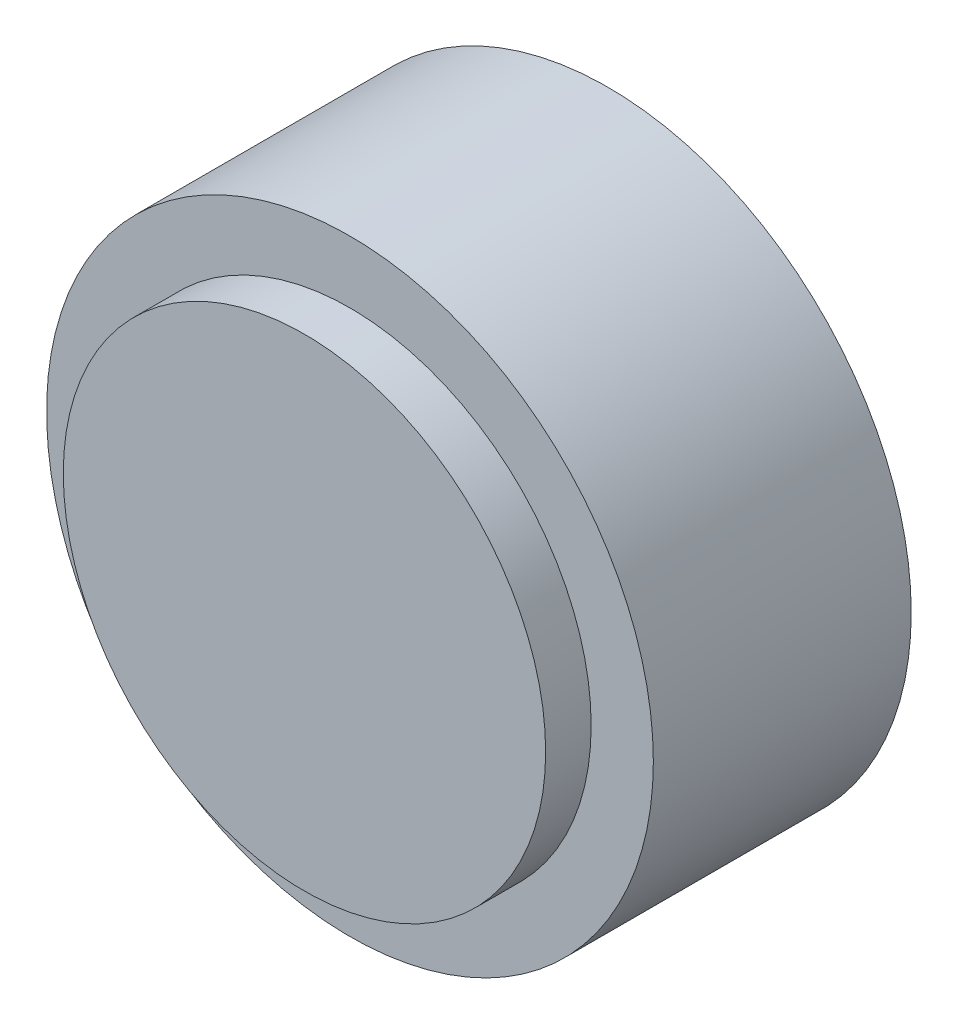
ISO-10303-21;
HEADER;
FILE_DESCRIPTION(('STEP AP214'),'2;1');
FILE_NAME('part.step','',(''),(''),'','','');
FILE_SCHEMA(('AUTOMOTIVE_DESIGN { 1 0 10303 214 1 1 1 1 }'));
ENDSEC;
DATA;
#1=APPLICATION_CONTEXT('core data for automotive mechanical design processes');
#2=APPLICATION_PROTOCOL_DEFINITION('international standard','automotive_design',2000,#1);
#3=PRODUCT_CONTEXT('',#1,'mechanical');
#4=PRODUCT('Part','Part','',(#3));
#5=PRODUCT_RELATED_PRODUCT_CATEGORY('part','',(#4));
#6=PRODUCT_DEFINITION_FORMATION('','',#4);
#7=PRODUCT_DEFINITION_CONTEXT('part definition',#1,'design');
#8=PRODUCT_DEFINITION('design','',#6,#7);
#9=PRODUCT_DEFINITION_SHAPE('','',#8);
#10=(LENGTH_UNIT() NAMED_UNIT(*) SI_UNIT(.MILLI.,.METRE.));
#11=(NAMED_UNIT(*) PLANE_ANGLE_UNIT() SI_UNIT($,.RADIAN.));
#12=(NAMED_UNIT(*) SI_UNIT($,.STERADIAN.) SOLID_ANGLE_UNIT());
#13=UNCERTAINTY_MEASURE_WITH_UNIT(LENGTH_MEASURE(1.E-05),#10,'distance_accuracy_value','');
#14=(GEOMETRIC_REPRESENTATION_CONTEXT(3) GLOBAL_UNCERTAINTY_ASSIGNED_CONTEXT((#13)) GLOBAL_UNIT_ASSIGNED_CONTEXT((#10,
#11,#12)) REPRESENTATION_CONTEXT('',''));
#15=CARTESIAN_POINT('',(0.,0.,0.));
#16=DIRECTION('',(0.,0.,1.));
#17=DIRECTION('',(1.,0.,0.));
#18=AXIS2_PLACEMENT_3D('',#15,#16,#17);
#19=CARTESIAN_POINT('',(0.,0.,30.));
#20=DIRECTION('',(0.,0.,1.));
#21=DIRECTION('',(1.,0.,0.));
#22=AXIS2_PLACEMENT_3D('',#19,#20,#21);
#23=CYLINDRICAL_SURFACE('',#22,10.);
#24=CARTESIAN_POINT('',(0.,0.,0.));
#25=DIRECTION('',(0.,0.,1.));
#26=DIRECTION('',(1.,0.,0.));
#27=AXIS2_PLACEMENT_3D('',#24,#25,#26);
#28=CIRCLE('',#27,10.);
#29=CARTESIAN_POINT('',(10.,0.,0.));
#30=VERTEX_POINT('',#29);
#31=EDGE_CURVE('E8',#30,#30,#28,.T.);
#32=ORIENTED_EDGE('',*,*,#31,.T.);
#33=EDGE_LOOP('',(#32));
#34=FACE_BOUND('',#33,.T.);
#35=CARTESIAN_POINT('',(0.,0.,8.5));
#36=DIRECTION('',(0.,0.,1.));
#37=DIRECTION('',(1.,0.,0.));
#38=AXIS2_PLACEMENT_3D('',#35,#36,#37);
#39=CIRCLE('',#38,10.);
#40=CARTESIAN_POINT('',(10.,0.,8.5));
#41=VERTEX_POINT('',#40);
#42=EDGE_CURVE('E29',#41,#41,#39,.T.);
#43=ORIENTED_EDGE('',*,*,#42,.F.);
#44=EDGE_LOOP('',(#43));
#45=FACE_BOUND('',#44,.T.);
#46=ADVANCED_FACE('F13',(#34,#45),#23,.T.);
#47=CARTESIAN_POINT('',(3.,0.,0.));
#48=DIRECTION('',(0.,0.,1.));
#49=DIRECTION('',(1.,0.,0.));
#50=AXIS2_PLACEMENT_3D('',#47,#48,#49);
#51=PLANE('',#50);
#52=ORIENTED_EDGE('',*,*,#31,.F.);
#53=EDGE_LOOP('',(#52));
#54=FACE_BOUND('',#53,.T.);
#55=CARTESIAN_POINT('',(0.,0.,0.));
#56=DIRECTION('',(0.,0.,1.));
#57=DIRECTION('',(1.,0.,0.));
#58=AXIS2_PLACEMENT_3D('',#55,#56,#57);
#59=CIRCLE('',#58,3.);
#60=CARTESIAN_POINT('',(3.,0.,0.));
#61=VERTEX_POINT('',#60);
#62=EDGE_CURVE('E20',#61,#61,#59,.T.);
#63=ORIENTED_EDGE('',*,*,#62,.T.);
#64=EDGE_LOOP('',(#63));
#65=FACE_BOUND('',#64,.T.);
#66=ADVANCED_FACE('F42',(#54,#65),#51,.F.);
#67=CARTESIAN_POINT('',(0.,0.,30.));
#68=DIRECTION('',(0.,0.,1.));
#69=DIRECTION('',(1.,0.,0.));
#70=AXIS2_PLACEMENT_3D('',#67,#68,#69);
#71=CYLINDRICAL_SURFACE('',#70,3.);
#72=CARTESIAN_POINT('',(0.,0.,5.8));
#73=DIRECTION('',(0.,0.,-1.));
#74=DIRECTION('',(-1.,0.,0.));
#75=AXIS2_PLACEMENT_3D('',#72,#73,#74);
#76=CIRCLE('',#75,3.);
#77=CARTESIAN_POINT('',(-3.,0.,5.8));
#78=VERTEX_POINT('',#77);
#79=EDGE_CURVE('E32',#78,#78,#76,.T.);
#80=ORIENTED_EDGE('',*,*,#79,.F.);
#81=EDGE_LOOP('',(#80));
#82=FACE_BOUND('',#81,.T.);
#83=ORIENTED_EDGE('',*,*,#62,.F.);
#84=EDGE_LOOP('',(#83));
#85=FACE_BOUND('',#84,.T.);
#86=ADVANCED_FACE('F38',(#82,#85),#71,.F.);
#87=CARTESIAN_POINT('',(0.,0.,20.));
#88=DIRECTION('',(0.,0.,1.));
#89=DIRECTION('',(1.,0.,0.));
#90=AXIS2_PLACEMENT_3D('',#87,#88,#89);
#91=CYLINDRICAL_SURFACE('',#90,7.95);
#92=CARTESIAN_POINT('',(0.,0.,8.5));
#93=DIRECTION('',(0.,0.,1.));
#94=DIRECTION('',(1.,0.,0.));
#95=AXIS2_PLACEMENT_3D('',#92,#93,#94);
#96=CIRCLE('',#95,7.95);
#97=CARTESIAN_POINT('',(7.95,0.,8.5));
#98=VERTEX_POINT('',#97);
#99=EDGE_CURVE('E26',#98,#98,#96,.T.);
#100=ORIENTED_EDGE('',*,*,#99,.T.);
#101=EDGE_LOOP('',(#100));
#102=FACE_BOUND('',#101,.T.);
#103=CARTESIAN_POINT('',(0.,0.,10.));
#104=DIRECTION('',(0.,0.,-1.));
#105=DIRECTION('',(-1.,0.,0.));
#106=AXIS2_PLACEMENT_3D('',#103,#104,#105);
#107=CIRCLE('',#106,7.95);
#108=CARTESIAN_POINT('',(-7.95,0.,10.));
#109=VERTEX_POINT('',#108);
#110=EDGE_CURVE('E16',#109,#109,#107,.T.);
#111=ORIENTED_EDGE('',*,*,#110,.T.);
#112=EDGE_LOOP('',(#111));
#113=FACE_BOUND('',#112,.T.);
#114=ADVANCED_FACE('F41',(#102,#113),#91,.T.);
#115=CARTESIAN_POINT('',(-7.95,0.,8.5));
#116=DIRECTION('',(0.,0.,1.));
#117=DIRECTION('',(1.,0.,0.));
#118=AXIS2_PLACEMENT_3D('',#115,#116,#117);
#119=PLANE('',#118);
#120=ORIENTED_EDGE('',*,*,#42,.T.);
#121=EDGE_LOOP('',(#120));
#122=FACE_BOUND('',#121,.T.);
#123=ORIENTED_EDGE('',*,*,#99,.F.);
#124=EDGE_LOOP('',(#123));
#125=FACE_BOUND('',#124,.T.);
#126=ADVANCED_FACE('F57',(#122,#125),#119,.T.);
#127=CARTESIAN_POINT('',(10.,0.,10.));
#128=DIRECTION('',(0.,0.,-1.));
#129=DIRECTION('',(-1.,0.,0.));
#130=AXIS2_PLACEMENT_3D('',#127,#128,#129);
#131=PLANE('',#130);
#132=ORIENTED_EDGE('',*,*,#110,.F.);
#133=EDGE_LOOP('',(#132));
#134=FACE_BOUND('',#133,.T.);
#135=ADVANCED_FACE('F54',(#134),#131,.F.);
#136=CARTESIAN_POINT('',(0.,0.,5.8));
#137=DIRECTION('',(0.,0.,-1.));
#138=DIRECTION('',(-1.,0.,0.));
#139=AXIS2_PLACEMENT_3D('',#136,#137,#138);
#140=PLANE('',#139);
#141=ORIENTED_EDGE('',*,*,#79,.T.);
#142=EDGE_LOOP('',(#141));
#143=FACE_BOUND('',#142,.T.);
#144=ADVANCED_FACE('F36',(#143),#140,.T.);
#145=CLOSED_SHELL('',(#46,#66,#86,#114,#126,#135,#144));
#146=MANIFOLD_SOLID_BREP('B1',#145);
#147=ADVANCED_BREP_SHAPE_REPRESENTATION('',(#18,#146),#14);
#148=SHAPE_DEFINITION_REPRESENTATION(#9,#147);
ENDSEC;
END-ISO-10303-21;
